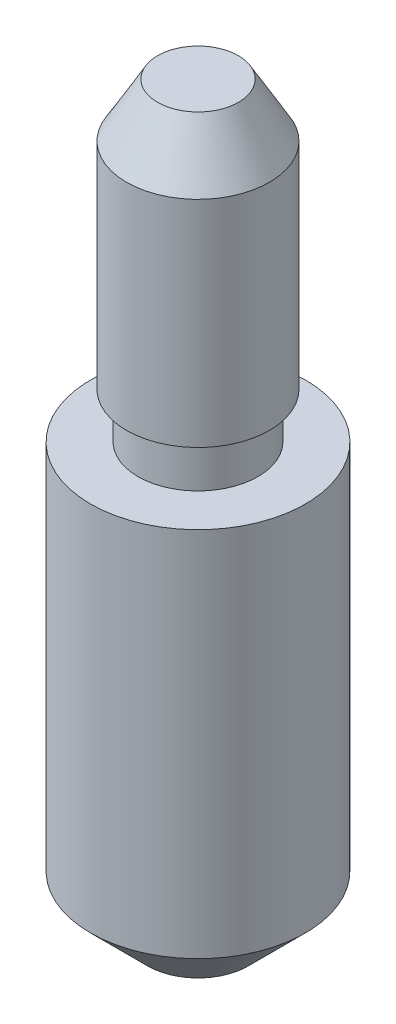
ISO-10303-21;
HEADER;
FILE_DESCRIPTION(('STEP AP214'),'2;1');
FILE_NAME('part.step','',(''),(''),'','','');
FILE_SCHEMA(('AUTOMOTIVE_DESIGN { 1 0 10303 214 1 1 1 1 }'));
ENDSEC;
DATA;
#1=APPLICATION_CONTEXT('core data for automotive mechanical design processes');
#2=APPLICATION_PROTOCOL_DEFINITION('international standard','automotive_design',2000,#1);
#3=PRODUCT_CONTEXT('',#1,'mechanical');
#4=PRODUCT('Part','Part','',(#3));
#5=PRODUCT_RELATED_PRODUCT_CATEGORY('part','',(#4));
#6=PRODUCT_DEFINITION_FORMATION('','',#4);
#7=PRODUCT_DEFINITION_CONTEXT('part definition',#1,'design');
#8=PRODUCT_DEFINITION('design','',#6,#7);
#9=PRODUCT_DEFINITION_SHAPE('','',#8);
#10=(LENGTH_UNIT() NAMED_UNIT(*) SI_UNIT(.MILLI.,.METRE.));
#11=(NAMED_UNIT(*) PLANE_ANGLE_UNIT() SI_UNIT($,.RADIAN.));
#12=(NAMED_UNIT(*) SI_UNIT($,.STERADIAN.) SOLID_ANGLE_UNIT());
#13=UNCERTAINTY_MEASURE_WITH_UNIT(LENGTH_MEASURE(1.E-05),#10,'distance_accuracy_value','');
#14=(GEOMETRIC_REPRESENTATION_CONTEXT(3) GLOBAL_UNCERTAINTY_ASSIGNED_CONTEXT((#13)) GLOBAL_UNIT_ASSIGNED_CONTEXT((#10,
#11,#12)) REPRESENTATION_CONTEXT('',''));
#15=CARTESIAN_POINT('',(0.,0.,0.));
#16=DIRECTION('',(0.,0.,1.));
#17=DIRECTION('',(1.,0.,0.));
#18=AXIS2_PLACEMENT_3D('',#15,#16,#17);
#19=CARTESIAN_POINT('',(0.,6.985,-0.898259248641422));
#20=DIRECTION('',(0.,-1.,0.));
#21=DIRECTION('',(0.,0.,-1.));
#22=AXIS2_PLACEMENT_3D('',#19,#20,#21);
#23=PLANE('',#22);
#24=CARTESIAN_POINT('',(0.,6.985,0.));
#25=DIRECTION('',(0.,1.,0.));
#26=DIRECTION('',(0.,0.,1.));
#27=AXIS2_PLACEMENT_3D('',#24,#25,#26);
#28=CIRCLE('',#27,0.898259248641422);
#29=CARTESIAN_POINT('',(0.,6.985,0.898259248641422));
#30=VERTEX_POINT('',#29);
#31=EDGE_CURVE('E38',#30,#30,#28,.T.);
#32=ORIENTED_EDGE('',*,*,#31,.T.);
#33=EDGE_LOOP('',(#32));
#34=FACE_BOUND('',#33,.T.);
#35=ADVANCED_FACE('F28',(#34),#23,.F.);
#36=CARTESIAN_POINT('',(0.,5.7912,0.));
#37=DIRECTION('',(0.,-1.,0.));
#38=DIRECTION('',(0.,0.,-1.));
#39=AXIS2_PLACEMENT_3D('',#36,#37,#38);
#40=CONICAL_SURFACE('',#39,1.5875,0.5235987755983);
#41=ORIENTED_EDGE('',*,*,#31,.F.);
#42=EDGE_LOOP('',(#41));
#43=FACE_BOUND('',#42,.T.);
#44=CARTESIAN_POINT('',(0.,5.7912,0.));
#45=DIRECTION('',(0.,1.,0.));
#46=DIRECTION('',(0.,0.,1.));
#47=AXIS2_PLACEMENT_3D('',#44,#45,#46);
#48=CIRCLE('',#47,1.5875);
#49=CARTESIAN_POINT('',(0.,5.7912,1.5875));
#50=VERTEX_POINT('',#49);
#51=EDGE_CURVE('E42',#50,#50,#48,.T.);
#52=ORIENTED_EDGE('',*,*,#51,.T.);
#53=EDGE_LOOP('',(#52));
#54=FACE_BOUND('',#53,.T.);
#55=ADVANCED_FACE('F76',(#43,#54),#40,.T.);
#56=CARTESIAN_POINT('',(0.,5.50248341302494,0.));
#57=DIRECTION('',(0.,1.,0.));
#58=DIRECTION('',(0.,0.,1.));
#59=AXIS2_PLACEMENT_3D('',#56,#57,#58);
#60=CYLINDRICAL_SURFACE('',#59,1.5875);
#61=ORIENTED_EDGE('',*,*,#51,.F.);
#62=EDGE_LOOP('',(#61));
#63=FACE_BOUND('',#62,.T.);
#64=CARTESIAN_POINT('',(0.,1.016,0.));
#65=DIRECTION('',(0.,1.,0.));
#66=DIRECTION('',(0.,0.,1.));
#67=AXIS2_PLACEMENT_3D('',#64,#65,#66);
#68=CIRCLE('',#67,1.5875);
#69=CARTESIAN_POINT('',(0.,1.016,1.5875));
#70=VERTEX_POINT('',#69);
#71=EDGE_CURVE('E47',#70,#70,#68,.T.);
#72=ORIENTED_EDGE('',*,*,#71,.T.);
#73=EDGE_LOOP('',(#72));
#74=FACE_BOUND('',#73,.T.);
#75=ADVANCED_FACE('F81',(#63,#74),#60,.T.);
#76=CARTESIAN_POINT('',(0.,1.016,-1.3335));
#77=DIRECTION('',(0.,1.,0.));
#78=DIRECTION('',(0.,0.,1.));
#79=AXIS2_PLACEMENT_3D('',#76,#77,#78);
#80=PLANE('',#79);
#81=ORIENTED_EDGE('',*,*,#71,.F.);
#82=EDGE_LOOP('',(#81));
#83=FACE_BOUND('',#82,.T.);
#84=CARTESIAN_POINT('',(0.,1.016,0.));
#85=DIRECTION('',(0.,1.,0.));
#86=DIRECTION('',(0.,0.,1.));
#87=AXIS2_PLACEMENT_3D('',#84,#85,#86);
#88=CIRCLE('',#87,1.3335);
#89=CARTESIAN_POINT('',(0.,1.016,1.3335));
#90=VERTEX_POINT('',#89);
#91=EDGE_CURVE('E50',#90,#90,#88,.T.);
#92=ORIENTED_EDGE('',*,*,#91,.T.);
#93=EDGE_LOOP('',(#92));
#94=FACE_BOUND('',#93,.T.);
#95=ADVANCED_FACE('F89',(#83,#94),#80,.F.);
#96=CARTESIAN_POINT('',(0.,5.50248341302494,0.));
#97=DIRECTION('',(0.,1.,0.));
#98=DIRECTION('',(0.,0.,1.));
#99=AXIS2_PLACEMENT_3D('',#96,#97,#98);
#100=CYLINDRICAL_SURFACE('',#99,1.3335);
#101=ORIENTED_EDGE('',*,*,#91,.F.);
#102=EDGE_LOOP('',(#101));
#103=FACE_BOUND('',#102,.T.);
#104=CARTESIAN_POINT('',(0.,0.,0.));
#105=DIRECTION('',(0.,1.,0.));
#106=DIRECTION('',(0.,0.,1.));
#107=AXIS2_PLACEMENT_3D('',#104,#105,#106);
#108=CIRCLE('',#107,1.3335);
#109=CARTESIAN_POINT('',(0.,0.,1.3335));
#110=VERTEX_POINT('',#109);
#111=EDGE_CURVE('E53',#110,#110,#108,.T.);
#112=ORIENTED_EDGE('',*,*,#111,.T.);
#113=EDGE_LOOP('',(#112));
#114=FACE_BOUND('',#113,.T.);
#115=ADVANCED_FACE('F72',(#103,#114),#100,.T.);
#116=CARTESIAN_POINT('',(0.,0.,-2.3876));
#117=DIRECTION('',(0.,-1.,0.));
#118=DIRECTION('',(0.,0.,-1.));
#119=AXIS2_PLACEMENT_3D('',#116,#117,#118);
#120=PLANE('',#119);
#121=ORIENTED_EDGE('',*,*,#111,.F.);
#122=EDGE_LOOP('',(#121));
#123=FACE_BOUND('',#122,.T.);
#124=CARTESIAN_POINT('',(0.,0.,0.));
#125=DIRECTION('',(0.,1.,0.));
#126=DIRECTION('',(0.,0.,1.));
#127=AXIS2_PLACEMENT_3D('',#124,#125,#126);
#128=CIRCLE('',#127,2.3876);
#129=CARTESIAN_POINT('',(0.,0.,2.3876));
#130=VERTEX_POINT('',#129);
#131=EDGE_CURVE('E56',#130,#130,#128,.T.);
#132=ORIENTED_EDGE('',*,*,#131,.T.);
#133=EDGE_LOOP('',(#132));
#134=FACE_BOUND('',#133,.T.);
#135=ADVANCED_FACE('F60',(#123,#134),#120,.F.);
#136=CARTESIAN_POINT('',(0.,5.50248341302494,0.));
#137=DIRECTION('',(0.,1.,0.));
#138=DIRECTION('',(0.,0.,1.));
#139=AXIS2_PLACEMENT_3D('',#136,#137,#138);
#140=CYLINDRICAL_SURFACE('',#139,2.3876);
#141=CARTESIAN_POINT('',(0.,-8.255,0.));
#142=DIRECTION('',(0.,1.,0.));
#143=DIRECTION('',(0.,0.,1.));
#144=AXIS2_PLACEMENT_3D('',#141,#142,#143);
#145=CIRCLE('',#144,2.3876);
#146=CARTESIAN_POINT('',(0.,-8.255,2.3876));
#147=VERTEX_POINT('',#146);
#148=EDGE_CURVE('E34',#147,#147,#145,.T.);
#149=ORIENTED_EDGE('',*,*,#148,.T.);
#150=EDGE_LOOP('',(#149));
#151=FACE_BOUND('',#150,.T.);
#152=ORIENTED_EDGE('',*,*,#131,.F.);
#153=EDGE_LOOP('',(#152));
#154=FACE_BOUND('',#153,.T.);
#155=ADVANCED_FACE('F62',(#151,#154),#140,.T.);
#156=CARTESIAN_POINT('',(0.,-9.525,0.));
#157=DIRECTION('',(0.,1.,0.));
#158=DIRECTION('',(0.,0.,1.));
#159=AXIS2_PLACEMENT_3D('',#156,#157,#158);
#160=PLANE('',#159);
#161=CARTESIAN_POINT('',(0.,-9.525,0.));
#162=DIRECTION('',(0.,1.,0.));
#163=DIRECTION('',(0.,0.,1.));
#164=AXIS2_PLACEMENT_3D('',#161,#162,#163);
#165=CIRCLE('',#164,1.1176);
#166=CARTESIAN_POINT('',(0.,-9.525,1.1176));
#167=VERTEX_POINT('',#166);
#168=EDGE_CURVE('E10',#167,#167,#165,.F.);
#169=ORIENTED_EDGE('',*,*,#168,.T.);
#170=EDGE_LOOP('',(#169));
#171=FACE_BOUND('',#170,.T.);
#172=ADVANCED_FACE('F64',(#171),#160,.F.);
#173=CARTESIAN_POINT('',(0.,-8.255,0.));
#174=DIRECTION('',(0.,1.,0.));
#175=DIRECTION('',(0.,0.,1.));
#176=AXIS2_PLACEMENT_3D('',#173,#174,#175);
#177=CONICAL_SURFACE('',#176,2.3876,0.785398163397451);
#178=ORIENTED_EDGE('',*,*,#168,.F.);
#179=EDGE_LOOP('',(#178));
#180=FACE_BOUND('',#179,.T.);
#181=ORIENTED_EDGE('',*,*,#148,.F.);
#182=EDGE_LOOP('',(#181));
#183=FACE_BOUND('',#182,.T.);
#184=ADVANCED_FACE('F70',(#180,#183),#177,.T.);
#185=CLOSED_SHELL('',(#35,#55,#75,#95,#115,#135,#155,#172,#184));
#186=MANIFOLD_SOLID_BREP('B2',#185);
#187=ADVANCED_BREP_SHAPE_REPRESENTATION('',(#18,#186),#14);
#188=SHAPE_DEFINITION_REPRESENTATION(#9,#187);
ENDSEC;
END-ISO-10303-21;
